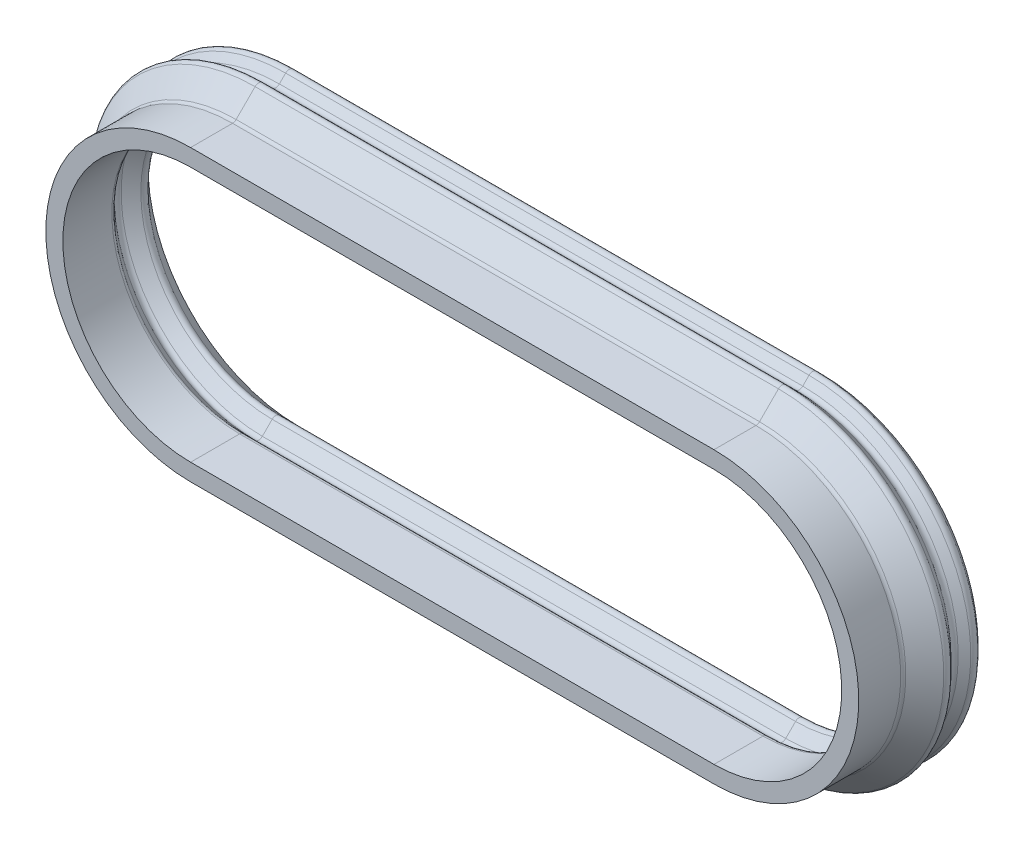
from build123d import *

# Parameters (mm, degrees)
FILLET1_R = 0.0762


with BuildPart() as part:
    # Sweep1: sweep along a path in Sketch1
    with BuildLine(Plane.XY) as sweep1_path:
        Line((-3.9022, 1.905), (3.9022, 1.905))
        ThreePointArc((3.9022, 1.905), (5.8072, 0), (3.9022, -1.905))
        Line((3.9022, -1.905), (-3.9022, -1.905))
        ThreePointArc((-3.9022, -1.905), (-5.8072, 0), (-3.9022, 1.905))
    # Sketch2 → Sweep1 (sweep)
    with BuildSketch(Plane(origin=(0, 0, 0), x_dir=(0, 0, -1), z_dir=(1, 0, 0))):
        Polygon((0, 1.905), (0.762, 1.905), (1.016, 2.159), (1.27, 1.905), (1.651, 2.286), (1.471394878, 2.465605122), (1.27, 2.264210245), (1.016, 2.518210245), (0.656789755, 2.159), (0, 2.159), align=None)
    sweep(path=sweep1_path.line)

    # Fillet1
    fillet1_edges = [part.edges().sort_by_distance(p)[0] for p in [
        (0, 2.159, -0.656789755),
        (0, 2.518210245, -1.016),
        (0, 2.264210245, -1.27),
        (0, 2.465605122, -1.471394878),
        (0, 2.286, -1.651),
        (0, 1.905, -1.27),
        (0, 2.159, -1.016),
        (0, 1.905, -0.762),
        (-5.8072, 0, -0.762),
        (-6.0612, 0, -1.016),
        (-5.8072, 0, -1.27),
        (-6.1882, 0, -1.651),
        (-6.367805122, 0, -1.471394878),
        (-6.166410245, 0, -1.27),
        (-6.420410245, 0, -1.016),
        (-6.0612, 0, -0.656789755),
        (0, -1.905, -0.762),
        (0, -2.159, -1.016),
        (0, -1.905, -1.27),
        (0, -2.286, -1.651),
        (0, -2.465605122, -1.471394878),
        (0, -2.264210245, -1.27),
        (0, -2.518210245, -1.016),
        (0, -2.159, -0.656789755),
        (5.8072, 0, -0.762),
        (6.0612, 0, -1.016),
        (5.8072, 0, -1.27),
        (6.1882, 0, -1.651),
        (6.367805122, 0, -1.471394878),
        (6.166410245, 0, -1.27),
        (6.420410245, 0, -1.016),
        (6.0612, 0, -0.656789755),
    ]]
    fillet(fillet1_edges, radius=FILLET1_R)


solid = part.part
